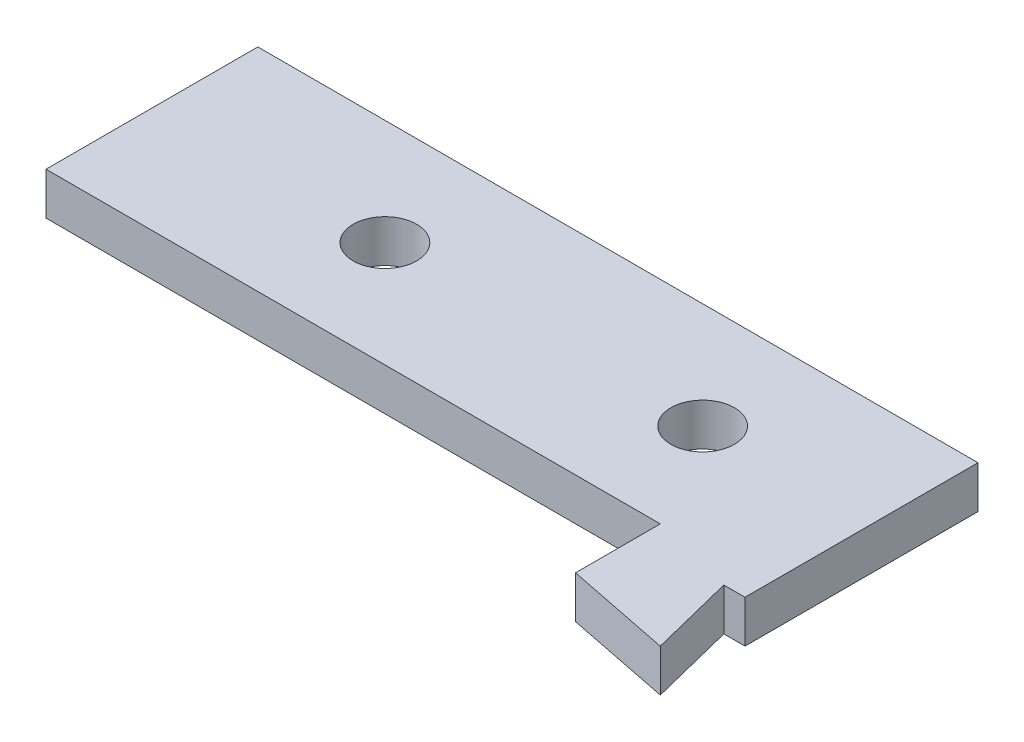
from build123d import *

# Parameters (mm, degrees)
SKETCH1_W          = 68
SKETCH1_H          = 30
EXTRUDE1_DEPTH     = 4
SKETCH2_R          = 3
CUT_EXTRUDE1_DEPTH = 75.431176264
CUT_EXTRUDE2_DEPTH = 75.431176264
CUT_EXTRUDE3_DEPTH = 75.431176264


with BuildPart() as part:
    # Sketch1 → Extrude1 (new body)
    with BuildSketch(Plane(origin=(0, 0, 0), x_dir=(1, 0, 0), z_dir=(0, 1, 0))):
        with Locations((34, 15)):
            Rectangle(SKETCH1_W, SKETCH1_H)
    extrude(amount=EXTRUDE1_DEPTH)

    # Sketch2 → Cut-Extrude1 (cut, through all)
    with BuildSketch(Plane(origin=(0, 4, 0), x_dir=(1, 0, 0), z_dir=(0, 1, 0))):
        with Locations(Location((22, 20, 0), (0, 0, 270))):
            Circle(SKETCH2_R)
        with Locations(Location((52, 20, 0), (0, 0, 270))):
            Circle(SKETCH2_R)
    extrude(amount=-CUT_EXTRUDE1_DEPTH, mode=Mode.SUBTRACT)

    # Sketch3 → Cut-Extrude2 (cut, through all)
    with BuildSketch(Plane(origin=(0, 4, 0), x_dir=(1, 0, 0), z_dir=(0, 1, 0))):
        Polygon((68, 0), (66, 8), (68, 8), align=None)
    extrude(amount=-CUT_EXTRUDE2_DEPTH, mode=Mode.SUBTRACT)

    # Sketch4 → Cut-Extrude3 (cut, through all)
    with BuildSketch(Plane(origin=(0, 4, 0), x_dir=(1, 0, 0), z_dir=(0, 1, 0))):
        Polygon((68, 0), (58, 2), (58, 10), (0, 10), (0, 0), align=None)
    extrude(amount=-CUT_EXTRUDE3_DEPTH, mode=Mode.SUBTRACT)


solid = part.part
